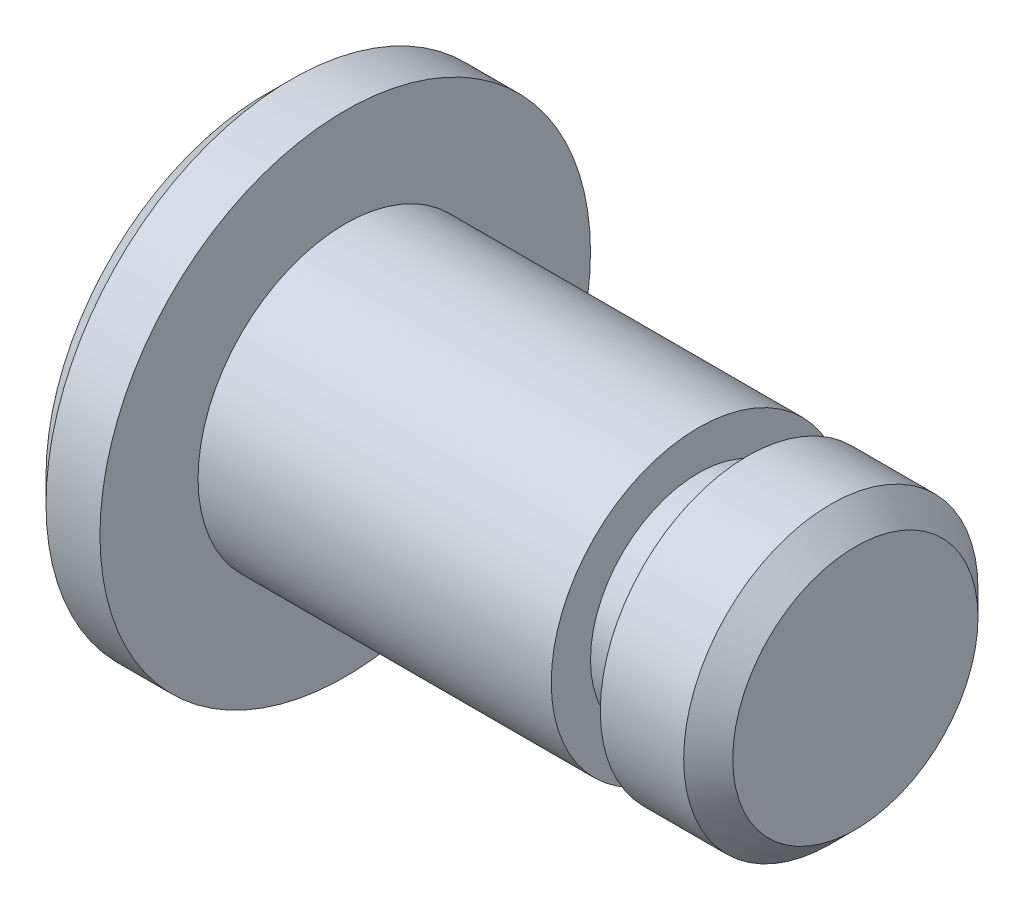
ISO-10303-21;
HEADER;
FILE_DESCRIPTION(('STEP AP214'),'2;1');
FILE_NAME('part.step','',(''),(''),'','','');
FILE_SCHEMA(('AUTOMOTIVE_DESIGN { 1 0 10303 214 1 1 1 1 }'));
ENDSEC;
DATA;
#1=APPLICATION_CONTEXT('core data for automotive mechanical design processes');
#2=APPLICATION_PROTOCOL_DEFINITION('international standard','automotive_design',2000,#1);
#3=PRODUCT_CONTEXT('',#1,'mechanical');
#4=PRODUCT('Part','Part','',(#3));
#5=PRODUCT_RELATED_PRODUCT_CATEGORY('part','',(#4));
#6=PRODUCT_DEFINITION_FORMATION('','',#4);
#7=PRODUCT_DEFINITION_CONTEXT('part definition',#1,'design');
#8=PRODUCT_DEFINITION('design','',#6,#7);
#9=PRODUCT_DEFINITION_SHAPE('','',#8);
#10=(LENGTH_UNIT() NAMED_UNIT(*) SI_UNIT(.MILLI.,.METRE.));
#11=(NAMED_UNIT(*) PLANE_ANGLE_UNIT() SI_UNIT($,.RADIAN.));
#12=(NAMED_UNIT(*) SI_UNIT($,.STERADIAN.) SOLID_ANGLE_UNIT());
#13=UNCERTAINTY_MEASURE_WITH_UNIT(LENGTH_MEASURE(1.E-05),#10,'distance_accuracy_value','');
#14=(GEOMETRIC_REPRESENTATION_CONTEXT(3) GLOBAL_UNCERTAINTY_ASSIGNED_CONTEXT((#13)) GLOBAL_UNIT_ASSIGNED_CONTEXT((#10,
#11,#12)) REPRESENTATION_CONTEXT('',''));
#15=CARTESIAN_POINT('',(0.,0.,0.));
#16=DIRECTION('',(0.,0.,1.));
#17=DIRECTION('',(1.,0.,0.));
#18=AXIS2_PLACEMENT_3D('',#15,#16,#17);
#19=CARTESIAN_POINT('',(-30.3011267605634,0.,0.));
#20=DIRECTION('',(-1.,0.,0.));
#21=DIRECTION('',(0.,0.,1.));
#22=AXIS2_PLACEMENT_3D('',#19,#20,#21);
#23=CYLINDRICAL_SURFACE('',#22,1.5);
#24=CARTESIAN_POINT('',(0.,0.,0.));
#25=DIRECTION('',(-1.,0.,0.));
#26=DIRECTION('',(0.,0.,1.));
#27=AXIS2_PLACEMENT_3D('',#24,#25,#26);
#28=CIRCLE('',#27,1.5);
#29=CARTESIAN_POINT('',(0.,0.,1.5));
#30=VERTEX_POINT('',#29);
#31=EDGE_CURVE('E48',#30,#30,#28,.T.);
#32=ORIENTED_EDGE('',*,*,#31,.F.);
#33=EDGE_LOOP('',(#32));
#34=FACE_BOUND('',#33,.T.);
#35=CARTESIAN_POINT('',(3.6,0.,0.));
#36=DIRECTION('',(1.,0.,0.));
#37=DIRECTION('',(0.,0.,-1.));
#38=AXIS2_PLACEMENT_3D('',#35,#36,#37);
#39=CIRCLE('',#38,1.5);
#40=CARTESIAN_POINT('',(3.6,0.,-1.5));
#41=VERTEX_POINT('',#40);
#42=EDGE_CURVE('E30',#41,#41,#39,.T.);
#43=ORIENTED_EDGE('',*,*,#42,.F.);
#44=EDGE_LOOP('',(#43));
#45=FACE_BOUND('',#44,.T.);
#46=ADVANCED_FACE('F27',(#34,#45),#23,.T.);
#47=CARTESIAN_POINT('',(-0.8,2.5,0.));
#48=DIRECTION('',(1.,0.,0.));
#49=DIRECTION('',(0.,0.,-1.));
#50=AXIS2_PLACEMENT_3D('',#47,#48,#49);
#51=PLANE('',#50);
#52=CARTESIAN_POINT('',(-0.8,0.,0.));
#53=DIRECTION('',(1.,0.,0.));
#54=DIRECTION('',(0.,0.,-1.));
#55=AXIS2_PLACEMENT_3D('',#52,#53,#54);
#56=CIRCLE('',#55,2.25000000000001);
#57=CARTESIAN_POINT('',(-0.8,0.,-2.25000000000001));
#58=VERTEX_POINT('',#57);
#59=EDGE_CURVE('E62',#58,#58,#56,.F.);
#60=ORIENTED_EDGE('',*,*,#59,.T.);
#61=EDGE_LOOP('',(#60));
#62=FACE_BOUND('',#61,.T.);
#63=ADVANCED_FACE('F78',(#62),#51,.F.);
#64=CARTESIAN_POINT('',(-30.3011267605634,0.,0.));
#65=DIRECTION('',(-1.,0.,0.));
#66=DIRECTION('',(0.,0.,1.));
#67=AXIS2_PLACEMENT_3D('',#64,#65,#66);
#68=CYLINDRICAL_SURFACE('',#67,2.5);
#69=CARTESIAN_POINT('',(-0.550000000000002,0.,0.));
#70=DIRECTION('',(1.,0.,0.));
#71=DIRECTION('',(0.,0.,-1.));
#72=AXIS2_PLACEMENT_3D('',#69,#70,#71);
#73=CIRCLE('',#72,2.5);
#74=CARTESIAN_POINT('',(-0.550000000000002,0.,-2.5));
#75=VERTEX_POINT('',#74);
#76=EDGE_CURVE('E39',#75,#75,#73,.T.);
#77=ORIENTED_EDGE('',*,*,#76,.T.);
#78=EDGE_LOOP('',(#77));
#79=FACE_BOUND('',#78,.T.);
#80=CARTESIAN_POINT('',(0.,0.,0.));
#81=DIRECTION('',(-1.,0.,0.));
#82=DIRECTION('',(0.,0.,1.));
#83=AXIS2_PLACEMENT_3D('',#80,#81,#82);
#84=CIRCLE('',#83,2.5);
#85=CARTESIAN_POINT('',(0.,0.,2.5));
#86=VERTEX_POINT('',#85);
#87=EDGE_CURVE('E59',#86,#86,#84,.T.);
#88=ORIENTED_EDGE('',*,*,#87,.T.);
#89=EDGE_LOOP('',(#88));
#90=FACE_BOUND('',#89,.T.);
#91=ADVANCED_FACE('F67',(#79,#90),#68,.T.);
#92=CARTESIAN_POINT('',(0.,1.5,0.));
#93=DIRECTION('',(-1.,0.,0.));
#94=DIRECTION('',(0.,0.,1.));
#95=AXIS2_PLACEMENT_3D('',#92,#93,#94);
#96=PLANE('',#95);
#97=ORIENTED_EDGE('',*,*,#87,.F.);
#98=EDGE_LOOP('',(#97));
#99=FACE_BOUND('',#98,.T.);
#100=ORIENTED_EDGE('',*,*,#31,.T.);
#101=EDGE_LOOP('',(#100));
#102=FACE_BOUND('',#101,.T.);
#103=ADVANCED_FACE('F74',(#99,#102),#96,.F.);
#104=CARTESIAN_POINT('',(-0.800000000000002,0.,0.));
#105=DIRECTION('',(1.,0.,0.));
#106=DIRECTION('',(0.,0.,-1.));
#107=AXIS2_PLACEMENT_3D('',#104,#105,#106);
#108=CONICAL_SURFACE('',#107,2.25,0.785398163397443);
#109=ORIENTED_EDGE('',*,*,#76,.F.);
#110=EDGE_LOOP('',(#109));
#111=FACE_BOUND('',#110,.T.);
#112=ORIENTED_EDGE('',*,*,#59,.F.);
#113=EDGE_LOOP('',(#112));
#114=FACE_BOUND('',#113,.T.);
#115=ADVANCED_FACE('F70',(#111,#114),#108,.T.);
#116=CARTESIAN_POINT('',(3.6,5.,0.));
#117=DIRECTION('',(1.,0.,0.));
#118=DIRECTION('',(0.,0.,-1.));
#119=AXIS2_PLACEMENT_3D('',#116,#117,#118);
#120=PLANE('',#119);
#121=CARTESIAN_POINT('',(3.6,0.,0.));
#122=DIRECTION('',(-1.,0.,0.));
#123=DIRECTION('',(0.,0.,1.));
#124=AXIS2_PLACEMENT_3D('',#121,#122,#123);
#125=CIRCLE('',#124,1.1);
#126=CARTESIAN_POINT('',(3.6,0.,1.1));
#127=VERTEX_POINT('',#126);
#128=EDGE_CURVE('E44',#127,#127,#125,.T.);
#129=ORIENTED_EDGE('',*,*,#128,.T.);
#130=EDGE_LOOP('',(#129));
#131=FACE_BOUND('',#130,.T.);
#132=ORIENTED_EDGE('',*,*,#42,.T.);
#133=EDGE_LOOP('',(#132));
#134=FACE_BOUND('',#133,.T.);
#135=ADVANCED_FACE('F73',(#131,#134),#120,.T.);
#136=CARTESIAN_POINT('',(4.1,5.,0.));
#137=DIRECTION('',(-1.,0.,0.));
#138=DIRECTION('',(0.,0.,1.));
#139=AXIS2_PLACEMENT_3D('',#136,#137,#138);
#140=PLANE('',#139);
#141=CARTESIAN_POINT('',(4.1,0.,0.));
#142=DIRECTION('',(-1.,0.,0.));
#143=DIRECTION('',(0.,0.,1.));
#144=AXIS2_PLACEMENT_3D('',#141,#142,#143);
#145=CIRCLE('',#144,1.1);
#146=CARTESIAN_POINT('',(4.1,0.,1.1));
#147=VERTEX_POINT('',#146);
#148=EDGE_CURVE('E50',#147,#147,#145,.T.);
#149=ORIENTED_EDGE('',*,*,#148,.F.);
#150=EDGE_LOOP('',(#149));
#151=FACE_BOUND('',#150,.T.);
#152=CARTESIAN_POINT('',(4.1,0.,0.));
#153=DIRECTION('',(-1.,0.,0.));
#154=DIRECTION('',(0.,0.,1.));
#155=AXIS2_PLACEMENT_3D('',#152,#153,#154);
#156=CIRCLE('',#155,1.5);
#157=CARTESIAN_POINT('',(4.1,0.,1.5));
#158=VERTEX_POINT('',#157);
#159=EDGE_CURVE('E42',#158,#158,#156,.T.);
#160=ORIENTED_EDGE('',*,*,#159,.T.);
#161=EDGE_LOOP('',(#160));
#162=FACE_BOUND('',#161,.T.);
#163=ADVANCED_FACE('F99',(#151,#162),#140,.T.);
#164=CARTESIAN_POINT('',(0.,0.,0.));
#165=DIRECTION('',(-1.,0.,0.));
#166=DIRECTION('',(0.,0.,1.));
#167=AXIS2_PLACEMENT_3D('',#164,#165,#166);
#168=CYLINDRICAL_SURFACE('',#167,1.1);
#169=ORIENTED_EDGE('',*,*,#148,.T.);
#170=EDGE_LOOP('',(#169));
#171=FACE_BOUND('',#170,.T.);
#172=ORIENTED_EDGE('',*,*,#128,.F.);
#173=EDGE_LOOP('',(#172));
#174=FACE_BOUND('',#173,.T.);
#175=ADVANCED_FACE('F92',(#171,#174),#168,.T.);
#176=CARTESIAN_POINT('',(5.2,1.5,0.));
#177=DIRECTION('',(-1.,0.,0.));
#178=DIRECTION('',(0.,0.,1.));
#179=AXIS2_PLACEMENT_3D('',#176,#177,#178);
#180=PLANE('',#179);
#181=CARTESIAN_POINT('',(5.2,0.,0.));
#182=DIRECTION('',(-1.,0.,0.));
#183=DIRECTION('',(0.,0.,1.));
#184=AXIS2_PLACEMENT_3D('',#181,#182,#183);
#185=CIRCLE('',#184,1.25);
#186=CARTESIAN_POINT('',(5.2,0.,1.25));
#187=VERTEX_POINT('',#186);
#188=EDGE_CURVE('E10',#187,#187,#185,.F.);
#189=ORIENTED_EDGE('',*,*,#188,.T.);
#190=EDGE_LOOP('',(#189));
#191=FACE_BOUND('',#190,.T.);
#192=ADVANCED_FACE('F89',(#191),#180,.F.);
#193=CARTESIAN_POINT('',(4.95,0.,0.));
#194=DIRECTION('',(-1.,0.,0.));
#195=DIRECTION('',(0.,0.,1.));
#196=AXIS2_PLACEMENT_3D('',#193,#194,#195);
#197=CONICAL_SURFACE('',#196,1.5,0.785398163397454);
#198=ORIENTED_EDGE('',*,*,#188,.F.);
#199=EDGE_LOOP('',(#198));
#200=FACE_BOUND('',#199,.T.);
#201=CARTESIAN_POINT('',(4.95,0.,0.));
#202=DIRECTION('',(-1.,0.,0.));
#203=DIRECTION('',(0.,0.,1.));
#204=AXIS2_PLACEMENT_3D('',#201,#202,#203);
#205=CIRCLE('',#204,1.5);
#206=CARTESIAN_POINT('',(4.95,0.,1.5));
#207=VERTEX_POINT('',#206);
#208=EDGE_CURVE('E34',#207,#207,#205,.T.);
#209=ORIENTED_EDGE('',*,*,#208,.F.);
#210=EDGE_LOOP('',(#209));
#211=FACE_BOUND('',#210,.T.);
#212=ADVANCED_FACE('F91',(#200,#211),#197,.T.);
#213=ORIENTED_EDGE('',*,*,#208,.T.);
#214=EDGE_LOOP('',(#213));
#215=FACE_BOUND('',#214,.T.);
#216=ORIENTED_EDGE('',*,*,#159,.F.);
#217=EDGE_LOOP('',(#216));
#218=FACE_BOUND('',#217,.T.);
#219=ADVANCED_FACE('F87',(#215,#218),#23,.T.);
#220=CLOSED_SHELL('',(#46,#63,#91,#103,#115,#135,#163,#175,#192,#212,#219));
#221=MANIFOLD_SOLID_BREP('B2',#220);
#222=ADVANCED_BREP_SHAPE_REPRESENTATION('',(#18,#221),#14);
#223=SHAPE_DEFINITION_REPRESENTATION(#9,#222);
ENDSEC;
END-ISO-10303-21;
